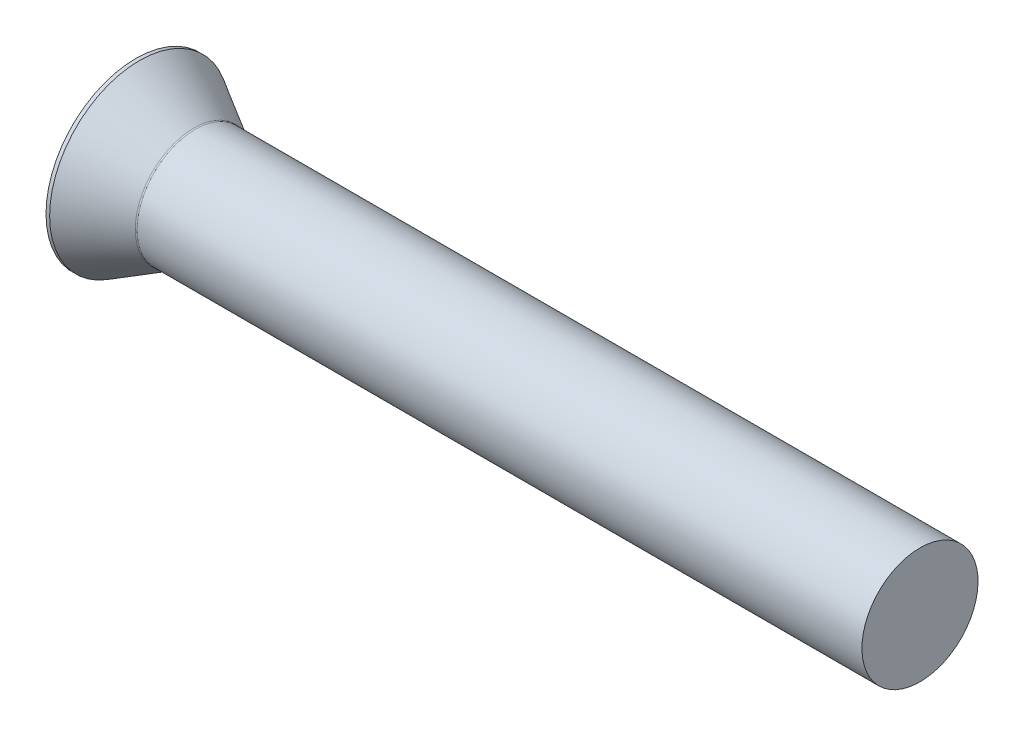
from build123d import *

# Parameters (mm, degrees)
SKETCH2_R      = 8
BASEBODY_DEPTH = 100
FILLET1_R      = 0.4


with BuildPart() as part:
    # Sketch3 → BaseHead (revolve)
    with BuildSketch(Plane(origin=(19.468089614, 10.942012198, 0), x_dir=(0, 1, 0), z_dir=(0, 0, 1)), mode=Mode.PRIVATE) as basehead_sk:
        with BuildLine():
            Line((-2.942012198, 8.068089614), (-10.942012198, 8.068089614))
            Line((-10.942012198, 8.068089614), (-10.942012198, 19.468089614))
            ThreePointArc((-10.942012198, 19.468089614), (-4.535561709, 18.622803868), (1.432404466, 16.144801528))
            Line((1.432404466, 16.144801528), (1.432404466, 15.644801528))
            Line((1.432404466, 15.644801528), (-2.942012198, 8.068089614))
        make_face()
    revolve(basehead_sk.sketch.rotate(Axis((-11.021250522, 0, 0), (1, 0, 0)), 90), axis=Axis((-11.021250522, 0, 0), (1, 0, 0)))

    # Sketch2 → BaseBody (add)
    with BuildSketch(Plane(origin=(11.4, 0.108124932, -0.559152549), x_dir=(0, 0, -1), z_dir=(1, 0, 0))):
        with Locations(Location((-0.559152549, -0.108124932, 0), (0, 0, 90))):
            Circle(SKETCH2_R)
    extrude(amount=BASEBODY_DEPTH)

    # Fillet1
    fillet1_edges = [part.edges().sort_by_distance(p)[0] for p in [
        (11.4, -5.656854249, -5.656854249),
    ]]
    fillet(fillet1_edges, radius=FILLET1_R)


solid = part.part
